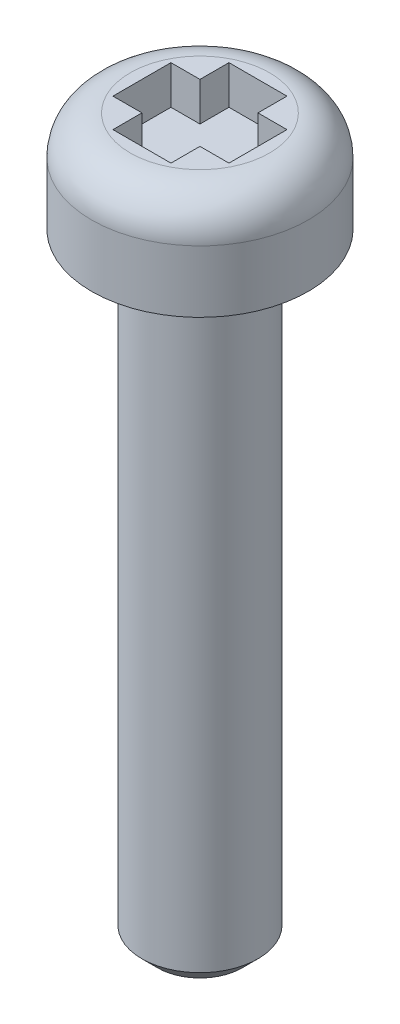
ISO-10303-21;
HEADER;
FILE_DESCRIPTION(('STEP AP214'),'2;1');
FILE_NAME('part.step','',(''),(''),'','','');
FILE_SCHEMA(('AUTOMOTIVE_DESIGN { 1 0 10303 214 1 1 1 1 }'));
ENDSEC;
DATA;
#1=APPLICATION_CONTEXT('core data for automotive mechanical design processes');
#2=APPLICATION_PROTOCOL_DEFINITION('international standard','automotive_design',2000,#1);
#3=PRODUCT_CONTEXT('',#1,'mechanical');
#4=PRODUCT('Part','Part','',(#3));
#5=PRODUCT_RELATED_PRODUCT_CATEGORY('part','',(#4));
#6=PRODUCT_DEFINITION_FORMATION('','',#4);
#7=PRODUCT_DEFINITION_CONTEXT('part definition',#1,'design');
#8=PRODUCT_DEFINITION('design','',#6,#7);
#9=PRODUCT_DEFINITION_SHAPE('','',#8);
#10=(LENGTH_UNIT() NAMED_UNIT(*) SI_UNIT(.MILLI.,.METRE.));
#11=(NAMED_UNIT(*) PLANE_ANGLE_UNIT() SI_UNIT($,.RADIAN.));
#12=(NAMED_UNIT(*) SI_UNIT($,.STERADIAN.) SOLID_ANGLE_UNIT());
#13=UNCERTAINTY_MEASURE_WITH_UNIT(LENGTH_MEASURE(1.E-05),#10,'distance_accuracy_value','');
#14=(GEOMETRIC_REPRESENTATION_CONTEXT(3) GLOBAL_UNCERTAINTY_ASSIGNED_CONTEXT((#13)) GLOBAL_UNIT_ASSIGNED_CONTEXT((#10,
#11,#12)) REPRESENTATION_CONTEXT('',''));
#15=CARTESIAN_POINT('',(0.,0.,0.));
#16=DIRECTION('',(0.,0.,1.));
#17=DIRECTION('',(1.,0.,0.));
#18=AXIS2_PLACEMENT_3D('',#15,#16,#17);
#19=CARTESIAN_POINT('',(2.8,0.,0.));
#20=DIRECTION('',(0.,1.,0.));
#21=DIRECTION('',(0.,0.,1.));
#22=AXIS2_PLACEMENT_3D('',#19,#20,#21);
#23=PLANE('',#22);
#24=CARTESIAN_POINT('',(0.,0.,0.));
#25=DIRECTION('',(0.,1.,0.));
#26=DIRECTION('',(0.,0.,1.));
#27=AXIS2_PLACEMENT_3D('',#24,#25,#26);
#28=CIRCLE('',#27,1.9572);
#29=CARTESIAN_POINT('',(0.,0.,1.9572));
#30=VERTEX_POINT('',#29);
#31=EDGE_CURVE('E209',#30,#30,#28,.T.);
#32=ORIENTED_EDGE('',*,*,#31,.T.);
#33=EDGE_LOOP('',(#32));
#34=FACE_BOUND('',#33,.T.);
#35=CARTESIAN_POINT('',(0.,0.,0.));
#36=DIRECTION('',(0.,1.,0.));
#37=DIRECTION('',(0.,0.,1.));
#38=AXIS2_PLACEMENT_3D('',#35,#36,#37);
#39=CIRCLE('',#38,2.8);
#40=CARTESIAN_POINT('',(0.,0.,2.8));
#41=VERTEX_POINT('',#40);
#42=EDGE_CURVE('E203',#41,#41,#39,.T.);
#43=ORIENTED_EDGE('',*,*,#42,.F.);
#44=EDGE_LOOP('',(#43));
#45=FACE_BOUND('',#44,.T.);
#46=ADVANCED_FACE('F31',(#34,#45),#23,.F.);
#47=CARTESIAN_POINT('',(0.750000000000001,1.6,1.5));
#48=DIRECTION('',(1.,0.,0.));
#49=DIRECTION('',(0.,0.,-1.));
#50=AXIS2_PLACEMENT_3D('',#47,#48,#49);
#51=PLANE('',#50);
#52=DIRECTION('',(0.,1.,0.));
#53=VECTOR('',#52,1.);
#54=CARTESIAN_POINT('',(0.75,1.6,0.749999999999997));
#55=LINE('',#54,#53);
#56=CARTESIAN_POINT('',(0.750000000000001,1.6,0.749999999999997));
#57=VERTEX_POINT('',#56);
#58=CARTESIAN_POINT('',(0.75,2.6,0.749999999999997));
#59=VERTEX_POINT('',#58);
#60=EDGE_CURVE('E153',#57,#59,#55,.T.);
#61=ORIENTED_EDGE('',*,*,#60,.F.);
#62=DIRECTION('',(0.,0.,-1.));
#63=VECTOR('',#62,1.);
#64=CARTESIAN_POINT('',(0.750000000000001,1.6,1.5));
#65=LINE('',#64,#63);
#66=CARTESIAN_POINT('',(0.750000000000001,1.6,1.5));
#67=VERTEX_POINT('',#66);
#68=EDGE_CURVE('E162',#67,#57,#65,.T.);
#69=ORIENTED_EDGE('',*,*,#68,.F.);
#70=DIRECTION('',(0.,1.,0.));
#71=VECTOR('',#70,1.);
#72=CARTESIAN_POINT('',(0.750000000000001,1.6,1.5));
#73=LINE('',#72,#71);
#74=CARTESIAN_POINT('',(0.750000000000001,2.6,1.5));
#75=VERTEX_POINT('',#74);
#76=EDGE_CURVE('E188',#67,#75,#73,.T.);
#77=ORIENTED_EDGE('',*,*,#76,.T.);
#78=DIRECTION('',(0.,0.,-1.));
#79=VECTOR('',#78,1.);
#80=CARTESIAN_POINT('',(0.750000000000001,2.6,1.5));
#81=LINE('',#80,#79);
#82=EDGE_CURVE('E175',#75,#59,#81,.T.);
#83=ORIENTED_EDGE('',*,*,#82,.T.);
#84=EDGE_LOOP('',(#61,#69,#77,#83));
#85=FACE_BOUND('',#84,.T.);
#86=ADVANCED_FACE('F225',(#85),#51,.F.);
#87=CARTESIAN_POINT('',(-0.749999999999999,1.6,1.5));
#88=DIRECTION('',(1.,0.,0.));
#89=DIRECTION('',(0.,0.,-1.));
#90=AXIS2_PLACEMENT_3D('',#87,#88,#89);
#91=PLANE('',#90);
#92=DIRECTION('',(0.,0.,-1.));
#93=VECTOR('',#92,1.);
#94=CARTESIAN_POINT('',(-0.749999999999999,1.6,1.5));
#95=LINE('',#94,#93);
#96=CARTESIAN_POINT('',(-0.749999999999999,1.6,1.5));
#97=VERTEX_POINT('',#96);
#98=CARTESIAN_POINT('',(-0.75,1.6,0.75));
#99=VERTEX_POINT('',#98);
#100=EDGE_CURVE('E169',#97,#99,#95,.T.);
#101=ORIENTED_EDGE('',*,*,#100,.T.);
#102=DIRECTION('',(0.,1.,0.));
#103=VECTOR('',#102,1.);
#104=CARTESIAN_POINT('',(-0.75,1.6,0.750000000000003));
#105=LINE('',#104,#103);
#106=CARTESIAN_POINT('',(-0.75,2.6,0.750000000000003));
#107=VERTEX_POINT('',#106);
#108=EDGE_CURVE('E150',#99,#107,#105,.T.);
#109=ORIENTED_EDGE('',*,*,#108,.T.);
#110=DIRECTION('',(0.,0.,-1.));
#111=VECTOR('',#110,1.);
#112=CARTESIAN_POINT('',(-0.749999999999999,2.6,1.5));
#113=LINE('',#112,#111);
#114=CARTESIAN_POINT('',(-0.749999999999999,2.6,1.5));
#115=VERTEX_POINT('',#114);
#116=EDGE_CURVE('E182',#115,#107,#113,.T.);
#117=ORIENTED_EDGE('',*,*,#116,.F.);
#118=DIRECTION('',(0.,1.,0.));
#119=VECTOR('',#118,1.);
#120=CARTESIAN_POINT('',(-0.749999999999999,1.6,1.5));
#121=LINE('',#120,#119);
#122=EDGE_CURVE('E191',#97,#115,#121,.T.);
#123=ORIENTED_EDGE('',*,*,#122,.F.);
#124=EDGE_LOOP('',(#101,#109,#117,#123));
#125=FACE_BOUND('',#124,.T.);
#126=ADVANCED_FACE('F231',(#125),#91,.T.);
#127=CARTESIAN_POINT('',(0.,11.592517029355,0.));
#128=DIRECTION('',(0.,1.,0.));
#129=DIRECTION('',(0.,0.,1.));
#130=AXIS2_PLACEMENT_3D('',#127,#128,#129);
#131=CYLINDRICAL_SURFACE('',#130,2.8);
#132=CARTESIAN_POINT('',(0.,1.6,0.));
#133=DIRECTION('',(0.,1.,0.));
#134=DIRECTION('',(0.,0.,1.));
#135=AXIS2_PLACEMENT_3D('',#132,#133,#134);
#136=CIRCLE('',#135,2.8);
#137=CARTESIAN_POINT('',(0.,1.6,2.8));
#138=VERTEX_POINT('',#137);
#139=EDGE_CURVE('E200',#138,#138,#136,.T.);
#140=ORIENTED_EDGE('',*,*,#139,.F.);
#141=EDGE_LOOP('',(#140));
#142=FACE_BOUND('',#141,.T.);
#143=ORIENTED_EDGE('',*,*,#42,.T.);
#144=EDGE_LOOP('',(#143));
#145=FACE_BOUND('',#144,.T.);
#146=ADVANCED_FACE('F237',(#142,#145),#131,.T.);
#147=CARTESIAN_POINT('',(0.,1.6,0.));
#148=DIRECTION('',(0.,1.,0.));
#149=DIRECTION('',(0.,0.,1.));
#150=AXIS2_PLACEMENT_3D('',#147,#148,#149);
#151=TOROIDAL_SURFACE('',#150,1.8,1.);
#152=CARTESIAN_POINT('',(0.,2.6,0.));
#153=DIRECTION('',(0.,1.,0.));
#154=DIRECTION('',(0.,0.,1.));
#155=AXIS2_PLACEMENT_3D('',#152,#153,#154);
#156=CIRCLE('',#155,1.8);
#157=CARTESIAN_POINT('',(0.,2.6,1.8));
#158=VERTEX_POINT('',#157);
#159=EDGE_CURVE('E190',#158,#158,#156,.T.);
#160=ORIENTED_EDGE('',*,*,#159,.F.);
#161=EDGE_LOOP('',(#160));
#162=FACE_BOUND('',#161,.T.);
#163=ORIENTED_EDGE('',*,*,#139,.T.);
#164=EDGE_LOOP('',(#163));
#165=FACE_BOUND('',#164,.T.);
#166=ADVANCED_FACE('F240',(#162,#165),#151,.T.);
#167=CARTESIAN_POINT('',(0.,2.6,0.));
#168=DIRECTION('',(0.,-1.,0.));
#169=DIRECTION('',(0.,0.,-1.));
#170=AXIS2_PLACEMENT_3D('',#167,#168,#169);
#171=PLANE('',#170);
#172=CARTESIAN_POINT('',(0.75,2.6,-0.750000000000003));
#173=VERTEX_POINT('',#172);
#174=CARTESIAN_POINT('',(0.75,2.6,-1.5));
#175=VERTEX_POINT('',#174);
#176=EDGE_CURVE('E161',#173,#175,#81,.T.);
#177=ORIENTED_EDGE('',*,*,#176,.F.);
#178=DIRECTION('',(-1.,0.,0.));
#179=VECTOR('',#178,1.);
#180=CARTESIAN_POINT('',(1.5,2.6,-0.750000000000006));
#181=LINE('',#180,#179);
#182=CARTESIAN_POINT('',(1.5,2.6,-0.750000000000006));
#183=VERTEX_POINT('',#182);
#184=EDGE_CURVE('E438',#183,#173,#181,.T.);
#185=ORIENTED_EDGE('',*,*,#184,.F.);
#186=DIRECTION('',(0.,0.,1.));
#187=VECTOR('',#186,1.);
#188=CARTESIAN_POINT('',(1.5,2.6,-0.750000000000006));
#189=LINE('',#188,#187);
#190=CARTESIAN_POINT('',(1.5,2.6,0.749999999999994));
#191=VERTEX_POINT('',#190);
#192=EDGE_CURVE('E128',#183,#191,#189,.T.);
#193=ORIENTED_EDGE('',*,*,#192,.T.);
#194=DIRECTION('',(-1.,0.,0.));
#195=VECTOR('',#194,1.);
#196=CARTESIAN_POINT('',(1.5,2.6,0.749999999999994));
#197=LINE('',#196,#195);
#198=EDGE_CURVE('E423',#191,#59,#197,.T.);
#199=ORIENTED_EDGE('',*,*,#198,.T.);
#200=ORIENTED_EDGE('',*,*,#82,.F.);
#201=DIRECTION('',(-1.,0.,0.));
#202=VECTOR('',#201,1.);
#203=CARTESIAN_POINT('',(0.750000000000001,2.6,1.5));
#204=LINE('',#203,#202);
#205=EDGE_CURVE('E185',#75,#115,#204,.T.);
#206=ORIENTED_EDGE('',*,*,#205,.T.);
#207=ORIENTED_EDGE('',*,*,#116,.T.);
#208=CARTESIAN_POINT('',(-1.5,2.6,0.750000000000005));
#209=VERTEX_POINT('',#208);
#210=EDGE_CURVE('E429',#107,#209,#197,.T.);
#211=ORIENTED_EDGE('',*,*,#210,.T.);
#212=DIRECTION('',(0.,0.,-1.));
#213=VECTOR('',#212,1.);
#214=CARTESIAN_POINT('',(-1.5,2.6,0.750000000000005));
#215=LINE('',#214,#213);
#216=CARTESIAN_POINT('',(-1.5,2.6,-0.749999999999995));
#217=VERTEX_POINT('',#216);
#218=EDGE_CURVE('E433',#209,#217,#215,.T.);
#219=ORIENTED_EDGE('',*,*,#218,.T.);
#220=CARTESIAN_POINT('',(-0.75,2.6,-0.749999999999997));
#221=VERTEX_POINT('',#220);
#222=EDGE_CURVE('E141',#221,#217,#181,.T.);
#223=ORIENTED_EDGE('',*,*,#222,.F.);
#224=CARTESIAN_POINT('',(-0.75,2.6,-1.5));
#225=VERTEX_POINT('',#224);
#226=EDGE_CURVE('E181',#221,#225,#113,.T.);
#227=ORIENTED_EDGE('',*,*,#226,.T.);
#228=DIRECTION('',(1.,0.,0.));
#229=VECTOR('',#228,1.);
#230=CARTESIAN_POINT('',(-0.75,2.6,-1.5));
#231=LINE('',#230,#229);
#232=EDGE_CURVE('E178',#225,#175,#231,.T.);
#233=ORIENTED_EDGE('',*,*,#232,.T.);
#234=EDGE_LOOP('',(#177,#185,#193,#199,#200,#206,#207,#211,#219,#223,#227,#233));
#235=FACE_BOUND('',#234,.T.);
#236=ORIENTED_EDGE('',*,*,#159,.T.);
#237=EDGE_LOOP('',(#236));
#238=FACE_BOUND('',#237,.T.);
#239=ADVANCED_FACE('F244',(#235,#238),#171,.F.);
#240=CARTESIAN_POINT('',(0.75,1.6,-0.75));
#241=VERTEX_POINT('',#240);
#242=CARTESIAN_POINT('',(0.75,1.6,-1.5));
#243=VERTEX_POINT('',#242);
#244=EDGE_CURVE('E166',#241,#243,#65,.T.);
#245=ORIENTED_EDGE('',*,*,#244,.F.);
#246=DIRECTION('',(0.,1.,0.));
#247=VECTOR('',#246,1.);
#248=CARTESIAN_POINT('',(0.75,1.6,-0.750000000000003));
#249=LINE('',#248,#247);
#250=EDGE_CURVE('E158',#241,#173,#249,.T.);
#251=ORIENTED_EDGE('',*,*,#250,.T.);
#252=ORIENTED_EDGE('',*,*,#176,.T.);
#253=DIRECTION('',(0.,1.,0.));
#254=VECTOR('',#253,1.);
#255=CARTESIAN_POINT('',(0.75,1.6,-1.5));
#256=LINE('',#255,#254);
#257=EDGE_CURVE('E174',#243,#175,#256,.T.);
#258=ORIENTED_EDGE('',*,*,#257,.F.);
#259=EDGE_LOOP('',(#245,#251,#252,#258));
#260=FACE_BOUND('',#259,.T.);
#261=ADVANCED_FACE('F234',(#260),#51,.F.);
#262=CARTESIAN_POINT('',(0.750000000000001,1.6,1.5));
#263=DIRECTION('',(0.,0.,-1.));
#264=DIRECTION('',(-1.,0.,0.));
#265=AXIS2_PLACEMENT_3D('',#262,#263,#264);
#266=PLANE('',#265);
#267=ORIENTED_EDGE('',*,*,#205,.F.);
#268=ORIENTED_EDGE('',*,*,#76,.F.);
#269=DIRECTION('',(-1.,0.,0.));
#270=VECTOR('',#269,1.);
#271=CARTESIAN_POINT('',(0.750000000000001,1.6,1.5));
#272=LINE('',#271,#270);
#273=EDGE_CURVE('E172',#67,#97,#272,.T.);
#274=ORIENTED_EDGE('',*,*,#273,.T.);
#275=ORIENTED_EDGE('',*,*,#122,.T.);
#276=EDGE_LOOP('',(#267,#268,#274,#275));
#277=FACE_BOUND('',#276,.T.);
#278=ADVANCED_FACE('F250',(#277),#266,.T.);
#279=DIRECTION('',(0.,1.,0.));
#280=VECTOR('',#279,1.);
#281=CARTESIAN_POINT('',(-0.75,1.6,-0.749999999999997));
#282=LINE('',#281,#280);
#283=CARTESIAN_POINT('',(-0.75,1.6,-0.749999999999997));
#284=VERTEX_POINT('',#283);
#285=EDGE_CURVE('E156',#284,#221,#282,.T.);
#286=ORIENTED_EDGE('',*,*,#285,.F.);
#287=CARTESIAN_POINT('',(-0.75,1.6,-1.5));
#288=VERTEX_POINT('',#287);
#289=EDGE_CURVE('E124',#284,#288,#95,.T.);
#290=ORIENTED_EDGE('',*,*,#289,.T.);
#291=DIRECTION('',(0.,1.,0.));
#292=VECTOR('',#291,1.);
#293=CARTESIAN_POINT('',(-0.75,1.6,-1.5));
#294=LINE('',#293,#292);
#295=EDGE_CURVE('E193',#288,#225,#294,.T.);
#296=ORIENTED_EDGE('',*,*,#295,.T.);
#297=ORIENTED_EDGE('',*,*,#226,.F.);
#298=EDGE_LOOP('',(#286,#290,#296,#297));
#299=FACE_BOUND('',#298,.T.);
#300=ADVANCED_FACE('F255',(#299),#91,.T.);
#301=CARTESIAN_POINT('',(-0.75,1.6,-1.5));
#302=DIRECTION('',(0.,0.,1.));
#303=DIRECTION('',(1.,0.,0.));
#304=AXIS2_PLACEMENT_3D('',#301,#302,#303);
#305=PLANE('',#304);
#306=ORIENTED_EDGE('',*,*,#232,.F.);
#307=ORIENTED_EDGE('',*,*,#295,.F.);
#308=DIRECTION('',(1.,0.,0.));
#309=VECTOR('',#308,1.);
#310=CARTESIAN_POINT('',(-0.75,1.6,-1.5));
#311=LINE('',#310,#309);
#312=EDGE_CURVE('E165',#288,#243,#311,.T.);
#313=ORIENTED_EDGE('',*,*,#312,.T.);
#314=ORIENTED_EDGE('',*,*,#257,.T.);
#315=EDGE_LOOP('',(#306,#307,#313,#314));
#316=FACE_BOUND('',#315,.T.);
#317=ADVANCED_FACE('F252',(#316),#305,.T.);
#318=CARTESIAN_POINT('',(0.75,1.6,-1.5));
#319=DIRECTION('',(0.,-1.,0.));
#320=DIRECTION('',(0.,0.,-1.));
#321=AXIS2_PLACEMENT_3D('',#318,#319,#320);
#322=PLANE('',#321);
#323=ORIENTED_EDGE('',*,*,#289,.F.);
#324=DIRECTION('',(-1.,0.,0.));
#325=VECTOR('',#324,1.);
#326=CARTESIAN_POINT('',(1.5,1.6,-0.750000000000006));
#327=LINE('',#326,#325);
#328=CARTESIAN_POINT('',(-1.5,1.6,-0.749999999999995));
#329=VERTEX_POINT('',#328);
#330=EDGE_CURVE('E119',#284,#329,#327,.T.);
#331=ORIENTED_EDGE('',*,*,#330,.T.);
#332=DIRECTION('',(0.,0.,-1.));
#333=VECTOR('',#332,1.);
#334=CARTESIAN_POINT('',(-1.5,1.6,0.750000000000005));
#335=LINE('',#334,#333);
#336=CARTESIAN_POINT('',(-1.5,1.6,0.750000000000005));
#337=VERTEX_POINT('',#336);
#338=EDGE_CURVE('E122',#337,#329,#335,.T.);
#339=ORIENTED_EDGE('',*,*,#338,.F.);
#340=DIRECTION('',(-1.,0.,0.));
#341=VECTOR('',#340,1.);
#342=CARTESIAN_POINT('',(1.5,1.6,0.749999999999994));
#343=LINE('',#342,#341);
#344=EDGE_CURVE('E46',#99,#337,#343,.T.);
#345=ORIENTED_EDGE('',*,*,#344,.F.);
#346=ORIENTED_EDGE('',*,*,#100,.F.);
#347=ORIENTED_EDGE('',*,*,#273,.F.);
#348=ORIENTED_EDGE('',*,*,#68,.T.);
#349=CARTESIAN_POINT('',(1.5,1.6,0.749999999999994));
#350=VERTEX_POINT('',#349);
#351=EDGE_CURVE('E146',#350,#57,#343,.T.);
#352=ORIENTED_EDGE('',*,*,#351,.F.);
#353=DIRECTION('',(0.,0.,1.));
#354=VECTOR('',#353,1.);
#355=CARTESIAN_POINT('',(1.5,1.6,-0.750000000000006));
#356=LINE('',#355,#354);
#357=CARTESIAN_POINT('',(1.5,1.6,-0.750000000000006));
#358=VERTEX_POINT('',#357);
#359=EDGE_CURVE('E142',#358,#350,#356,.T.);
#360=ORIENTED_EDGE('',*,*,#359,.F.);
#361=EDGE_CURVE('E53',#358,#241,#327,.T.);
#362=ORIENTED_EDGE('',*,*,#361,.T.);
#363=ORIENTED_EDGE('',*,*,#244,.T.);
#364=ORIENTED_EDGE('',*,*,#312,.F.);
#365=EDGE_LOOP('',(#323,#331,#339,#345,#346,#347,#348,#352,#360,#362,#363,#364));
#366=FACE_BOUND('',#365,.T.);
#367=ADVANCED_FACE('F121',(#366),#322,.F.);
#368=CARTESIAN_POINT('',(1.5,1.6,0.749999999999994));
#369=DIRECTION('',(0.,0.,-1.));
#370=DIRECTION('',(-1.,0.,0.));
#371=AXIS2_PLACEMENT_3D('',#368,#369,#370);
#372=PLANE('',#371);
#373=ORIENTED_EDGE('',*,*,#344,.T.);
#374=DIRECTION('',(0.,1.,0.));
#375=VECTOR('',#374,1.);
#376=CARTESIAN_POINT('',(-1.5,1.6,0.750000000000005));
#377=LINE('',#376,#375);
#378=EDGE_CURVE('E137',#337,#209,#377,.T.);
#379=ORIENTED_EDGE('',*,*,#378,.T.);
#380=ORIENTED_EDGE('',*,*,#210,.F.);
#381=ORIENTED_EDGE('',*,*,#108,.F.);
#382=EDGE_LOOP('',(#373,#379,#380,#381));
#383=FACE_BOUND('',#382,.T.);
#384=ADVANCED_FACE('F265',(#383),#372,.T.);
#385=CARTESIAN_POINT('',(1.5,1.6,-0.750000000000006));
#386=DIRECTION('',(0.,0.,-1.));
#387=DIRECTION('',(-1.,0.,0.));
#388=AXIS2_PLACEMENT_3D('',#385,#386,#387);
#389=PLANE('',#388);
#390=ORIENTED_EDGE('',*,*,#285,.T.);
#391=ORIENTED_EDGE('',*,*,#222,.T.);
#392=DIRECTION('',(0.,1.,0.));
#393=VECTOR('',#392,1.);
#394=CARTESIAN_POINT('',(-1.5,1.6,-0.749999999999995));
#395=LINE('',#394,#393);
#396=EDGE_CURVE('E135',#329,#217,#395,.T.);
#397=ORIENTED_EDGE('',*,*,#396,.F.);
#398=ORIENTED_EDGE('',*,*,#330,.F.);
#399=EDGE_LOOP('',(#390,#391,#397,#398));
#400=FACE_BOUND('',#399,.T.);
#401=ADVANCED_FACE('F139',(#400),#389,.F.);
#402=CARTESIAN_POINT('',(-1.5,1.6,0.750000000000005));
#403=DIRECTION('',(1.,0.,0.));
#404=DIRECTION('',(0.,0.,-1.));
#405=AXIS2_PLACEMENT_3D('',#402,#403,#404);
#406=PLANE('',#405);
#407=ORIENTED_EDGE('',*,*,#218,.F.);
#408=ORIENTED_EDGE('',*,*,#378,.F.);
#409=ORIENTED_EDGE('',*,*,#338,.T.);
#410=ORIENTED_EDGE('',*,*,#396,.T.);
#411=EDGE_LOOP('',(#407,#408,#409,#410));
#412=FACE_BOUND('',#411,.T.);
#413=ADVANCED_FACE('F134',(#412),#406,.T.);
#414=ORIENTED_EDGE('',*,*,#361,.F.);
#415=DIRECTION('',(0.,1.,0.));
#416=VECTOR('',#415,1.);
#417=CARTESIAN_POINT('',(1.5,1.6,-0.750000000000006));
#418=LINE('',#417,#416);
#419=EDGE_CURVE('E154',#358,#183,#418,.T.);
#420=ORIENTED_EDGE('',*,*,#419,.T.);
#421=ORIENTED_EDGE('',*,*,#184,.T.);
#422=ORIENTED_EDGE('',*,*,#250,.F.);
#423=EDGE_LOOP('',(#414,#420,#421,#422));
#424=FACE_BOUND('',#423,.T.);
#425=ADVANCED_FACE('F268',(#424),#389,.F.);
#426=ORIENTED_EDGE('',*,*,#60,.T.);
#427=ORIENTED_EDGE('',*,*,#198,.F.);
#428=DIRECTION('',(0.,1.,0.));
#429=VECTOR('',#428,1.);
#430=CARTESIAN_POINT('',(1.5,1.6,0.749999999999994));
#431=LINE('',#430,#429);
#432=EDGE_CURVE('E144',#350,#191,#431,.T.);
#433=ORIENTED_EDGE('',*,*,#432,.F.);
#434=ORIENTED_EDGE('',*,*,#351,.T.);
#435=EDGE_LOOP('',(#426,#427,#433,#434));
#436=FACE_BOUND('',#435,.T.);
#437=ADVANCED_FACE('F274',(#436),#372,.T.);
#438=CARTESIAN_POINT('',(1.5,1.6,-0.750000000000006));
#439=DIRECTION('',(-1.,0.,0.));
#440=DIRECTION('',(0.,0.,1.));
#441=AXIS2_PLACEMENT_3D('',#438,#439,#440);
#442=PLANE('',#441);
#443=ORIENTED_EDGE('',*,*,#192,.F.);
#444=ORIENTED_EDGE('',*,*,#419,.F.);
#445=ORIENTED_EDGE('',*,*,#359,.T.);
#446=ORIENTED_EDGE('',*,*,#432,.T.);
#447=EDGE_LOOP('',(#443,#444,#445,#446));
#448=FACE_BOUND('',#447,.T.);
#449=ADVANCED_FACE('F275',(#448),#442,.T.);
#450=CARTESIAN_POINT('',(0.,-16.,0.));
#451=DIRECTION('',(0.,1.,0.));
#452=DIRECTION('',(0.,0.,1.));
#453=AXIS2_PLACEMENT_3D('',#450,#451,#452);
#454=CYLINDRICAL_SURFACE('',#453,1.5);
#455=CARTESIAN_POINT('',(0.,-15.5936,0.));
#456=DIRECTION('',(0.,-1.,0.));
#457=DIRECTION('',(0.,0.,-1.));
#458=AXIS2_PLACEMENT_3D('',#455,#456,#457);
#459=CIRCLE('',#458,1.5);
#460=CARTESIAN_POINT('',(0.,-15.5936,1.5));
#461=VERTEX_POINT('',#460);
#462=EDGE_CURVE('E11',#461,#461,#459,.F.);
#463=ORIENTED_EDGE('',*,*,#462,.T.);
#464=EDGE_LOOP('',(#463));
#465=FACE_BOUND('',#464,.T.);
#466=CARTESIAN_POINT('',(0.,-0.4572,0.));
#467=DIRECTION('',(0.,1.,0.));
#468=DIRECTION('',(0.,0.,1.));
#469=AXIS2_PLACEMENT_3D('',#466,#467,#468);
#470=CIRCLE('',#469,1.5);
#471=CARTESIAN_POINT('',(0.,-0.4572,1.5));
#472=VERTEX_POINT('',#471);
#473=EDGE_CURVE('E206',#472,#472,#470,.F.);
#474=ORIENTED_EDGE('',*,*,#473,.T.);
#475=EDGE_LOOP('',(#474));
#476=FACE_BOUND('',#475,.T.);
#477=ADVANCED_FACE('F278',(#465,#476),#454,.T.);
#478=CARTESIAN_POINT('',(0.,-16.,0.));
#479=DIRECTION('',(0.,-1.,0.));
#480=DIRECTION('',(0.,0.,-1.));
#481=AXIS2_PLACEMENT_3D('',#478,#479,#480);
#482=PLANE('',#481);
#483=CARTESIAN_POINT('',(0.,-16.,0.));
#484=DIRECTION('',(0.,-1.,0.));
#485=DIRECTION('',(0.,0.,-1.));
#486=AXIS2_PLACEMENT_3D('',#483,#484,#485);
#487=CIRCLE('',#486,1.0936);
#488=CARTESIAN_POINT('',(0.,-16.,1.0936));
#489=VERTEX_POINT('',#488);
#490=EDGE_CURVE('E39',#489,#489,#487,.T.);
#491=ORIENTED_EDGE('',*,*,#490,.T.);
#492=EDGE_LOOP('',(#491));
#493=FACE_BOUND('',#492,.T.);
#494=ADVANCED_FACE('F214',(#493),#482,.T.);
#495=CARTESIAN_POINT('',(0.,-0.4572,0.));
#496=DIRECTION('',(0.,1.,0.));
#497=DIRECTION('',(0.,0.,1.));
#498=AXIS2_PLACEMENT_3D('',#495,#496,#497);
#499=TOROIDAL_SURFACE('',#498,1.9572,0.4572);
#500=ORIENTED_EDGE('',*,*,#31,.F.);
#501=EDGE_LOOP('',(#500));
#502=FACE_BOUND('',#501,.T.);
#503=ORIENTED_EDGE('',*,*,#473,.F.);
#504=EDGE_LOOP('',(#503));
#505=FACE_BOUND('',#504,.T.);
#506=ADVANCED_FACE('F217',(#502,#505),#499,.F.);
#507=CARTESIAN_POINT('',(0.,-16.,0.));
#508=DIRECTION('',(0.,1.,0.));
#509=DIRECTION('',(0.,0.,1.));
#510=AXIS2_PLACEMENT_3D('',#507,#508,#509);
#511=CONICAL_SURFACE('',#510,1.0936,0.785398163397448);
#512=CARTESIAN_POINT('',(0.,-15.5936,1.5));
#513=CARTESIAN_POINT('',(0.,-15.5978333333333,1.49576666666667));
#514=CARTESIAN_POINT('',(0.,-15.6020666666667,1.49153333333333));
#515=CARTESIAN_POINT('',(0.,-15.6105333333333,1.48306666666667));
#516=CARTESIAN_POINT('',(0.,-15.6147666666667,1.47883333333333));
#517=CARTESIAN_POINT('',(0.,-15.6232333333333,1.47036666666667));
#518=CARTESIAN_POINT('',(0.,-15.6274666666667,1.46613333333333));
#519=CARTESIAN_POINT('',(0.,-15.6359333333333,1.45766666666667));
#520=CARTESIAN_POINT('',(0.,-15.6401666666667,1.45343333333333));
#521=CARTESIAN_POINT('',(0.,-15.6486333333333,1.44496666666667));
#522=CARTESIAN_POINT('',(0.,-15.6528666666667,1.44073333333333));
#523=CARTESIAN_POINT('',(0.,-15.6613333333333,1.43226666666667));
#524=CARTESIAN_POINT('',(0.,-15.6655666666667,1.42803333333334));
#525=CARTESIAN_POINT('',(0.,-15.6740333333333,1.41956666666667));
#526=CARTESIAN_POINT('',(0.,-15.6782666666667,1.41533333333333));
#527=CARTESIAN_POINT('',(0.,-15.6867333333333,1.40686666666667));
#528=CARTESIAN_POINT('',(0.,-15.6909666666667,1.40263333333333));
#529=CARTESIAN_POINT('',(0.,-15.6994333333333,1.39416666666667));
#530=CARTESIAN_POINT('',(0.,-15.7036666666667,1.38993333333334));
#531=CARTESIAN_POINT('',(0.,-15.7121333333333,1.38146666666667));
#532=CARTESIAN_POINT('',(0.,-15.7163666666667,1.37723333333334));
#533=CARTESIAN_POINT('',(0.,-15.7248333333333,1.36876666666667));
#534=CARTESIAN_POINT('',(0.,-15.7290666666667,1.36453333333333));
#535=CARTESIAN_POINT('',(0.,-15.7375333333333,1.35606666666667));
#536=CARTESIAN_POINT('',(0.,-15.7417666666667,1.35183333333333));
#537=CARTESIAN_POINT('',(0.,-15.7502333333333,1.34336666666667));
#538=CARTESIAN_POINT('',(0.,-15.7544666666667,1.33913333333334));
#539=CARTESIAN_POINT('',(0.,-15.7629333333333,1.33066666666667));
#540=CARTESIAN_POINT('',(0.,-15.7671666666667,1.32643333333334));
#541=CARTESIAN_POINT('',(0.,-15.7756333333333,1.31796666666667));
#542=CARTESIAN_POINT('',(0.,-15.7798666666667,1.31373333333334));
#543=CARTESIAN_POINT('',(0.,-15.7883333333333,1.30526666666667));
#544=CARTESIAN_POINT('',(0.,-15.7925666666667,1.30103333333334));
#545=CARTESIAN_POINT('',(0.,-15.8010333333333,1.29256666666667));
#546=CARTESIAN_POINT('',(0.,-15.8052666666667,1.28833333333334));
#547=CARTESIAN_POINT('',(0.,-15.8137333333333,1.27986666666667));
#548=CARTESIAN_POINT('',(0.,-15.8179666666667,1.27563333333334));
#549=CARTESIAN_POINT('',(0.,-15.8264333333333,1.26716666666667));
#550=CARTESIAN_POINT('',(0.,-15.8306666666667,1.26293333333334));
#551=CARTESIAN_POINT('',(0.,-15.8391333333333,1.25446666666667));
#552=CARTESIAN_POINT('',(0.,-15.8433666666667,1.25023333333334));
#553=CARTESIAN_POINT('',(0.,-15.8518333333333,1.24176666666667));
#554=CARTESIAN_POINT('',(0.,-15.8560666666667,1.23753333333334));
#555=CARTESIAN_POINT('',(0.,-15.8645333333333,1.22906666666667));
#556=CARTESIAN_POINT('',(0.,-15.8687666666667,1.22483333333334));
#557=CARTESIAN_POINT('',(0.,-15.8772333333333,1.21636666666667));
#558=CARTESIAN_POINT('',(0.,-15.8814666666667,1.21213333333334));
#559=CARTESIAN_POINT('',(0.,-15.8899333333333,1.20366666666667));
#560=CARTESIAN_POINT('',(0.,-15.8941666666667,1.19943333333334));
#561=CARTESIAN_POINT('',(0.,-15.9026333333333,1.19096666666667));
#562=CARTESIAN_POINT('',(0.,-15.9068666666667,1.18673333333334));
#563=CARTESIAN_POINT('',(0.,-15.9153333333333,1.17826666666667));
#564=CARTESIAN_POINT('',(0.,-15.9195666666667,1.17403333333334));
#565=CARTESIAN_POINT('',(0.,-15.9280333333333,1.16556666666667));
#566=CARTESIAN_POINT('',(0.,-15.9322666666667,1.16133333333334));
#567=CARTESIAN_POINT('',(0.,-15.9407333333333,1.15286666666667));
#568=CARTESIAN_POINT('',(0.,-15.9449666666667,1.14863333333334));
#569=CARTESIAN_POINT('',(0.,-15.9534333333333,1.14016666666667));
#570=CARTESIAN_POINT('',(0.,-15.9576666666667,1.13593333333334));
#571=CARTESIAN_POINT('',(0.,-15.9661333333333,1.12746666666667));
#572=CARTESIAN_POINT('',(0.,-15.9703666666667,1.12323333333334));
#573=CARTESIAN_POINT('',(0.,-15.9788333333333,1.11476666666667));
#574=CARTESIAN_POINT('',(0.,-15.9830666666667,1.11053333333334));
#575=CARTESIAN_POINT('',(0.,-15.9915333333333,1.10206666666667));
#576=CARTESIAN_POINT('',(0.,-15.9957666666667,1.09783333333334));
#577=CARTESIAN_POINT('',(0.,-16.,1.0936));
#578=B_SPLINE_CURVE_WITH_KNOTS('',3,(#512,#513,#514,#515,#516,#517,#518,#519,#520,#521,#522,
#523,#524,#525,#526,#527,#528,#529,#530,#531,#532,#533,#534,#535,#536,#537,#538,#539,#540,#541,
#542,#543,#544,#545,#546,#547,#548,#549,#550,#551,#552,#553,#554,#555,#556,#557,#558,#559,#560,
#561,#562,#563,#564,#565,#566,#567,#568,#569,#570,#571,#572,#573,#574,#575,#576,#577),
.UNSPECIFIED.,.F.,.F.,(4,2,2,2,2,2,2,2,2,2,2,2,2,2,2,2,2,2,2,2,2,2,2,2,2,2,2,2,2,2,2,2,4),(0.,
0.0179605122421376,0.0359210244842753,0.0538815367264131,0.0718420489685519,0.0898025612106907,
0.10776307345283,0.125723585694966,0.143684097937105,0.161644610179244,0.179605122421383,
0.197565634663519,0.215526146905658,0.233486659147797,0.251447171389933,0.269407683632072,
0.287368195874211,0.30532870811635,0.323289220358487,0.341249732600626,0.359210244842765,
0.377170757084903,0.39513126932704,0.413091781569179,0.431052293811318,0.449012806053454,
0.466973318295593,0.484933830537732,0.502894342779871,0.520854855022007,0.538815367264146,
0.556775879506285,0.574736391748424),.UNSPECIFIED.);
#579=EDGE_CURVE('BSEAM33',#461,#489,#578,.T.);
#580=ORIENTED_EDGE('',*,*,#462,.F.);
#581=ORIENTED_EDGE('',*,*,#490,.F.);
#582=ORIENTED_EDGE('',*,*,#579,.T.);
#583=ORIENTED_EDGE('',*,*,#579,.F.);
#584=EDGE_LOOP('',(#580,#582,#581,#583));
#585=FACE_BOUND('',#584,.T.);
#586=ADVANCED_FACE('F33',(#585),#511,.T.);
#587=CLOSED_SHELL('',(#46,#86,#126,#146,#166,#239,#261,#278,#300,#317,#367,#384,#401,#413,#425,
#437,#449,#477,#494,#506,#586));
#588=MANIFOLD_SOLID_BREP('B2',#587);
#589=ADVANCED_BREP_SHAPE_REPRESENTATION('',(#18,#588),#14);
#590=SHAPE_DEFINITION_REPRESENTATION(#9,#589);
ENDSEC;
END-ISO-10303-21;
